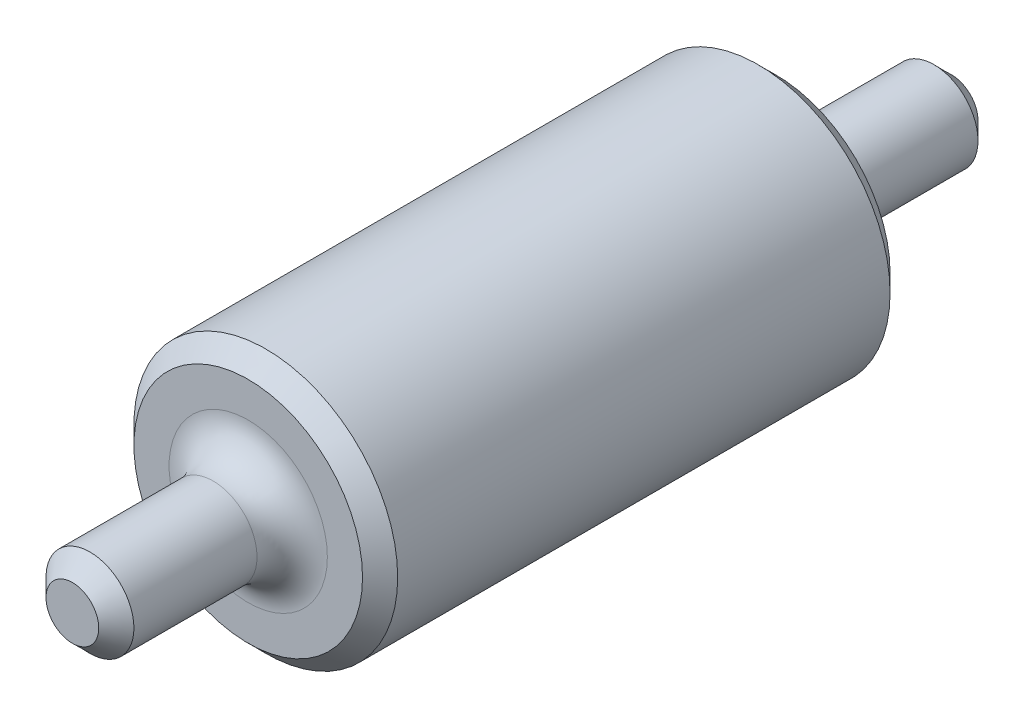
ISO-10303-21;
HEADER;
FILE_DESCRIPTION(('STEP AP214'),'2;1');
FILE_NAME('part.step','',(''),(''),'','','');
FILE_SCHEMA(('AUTOMOTIVE_DESIGN { 1 0 10303 214 1 1 1 1 }'));
ENDSEC;
DATA;
#1=APPLICATION_CONTEXT('core data for automotive mechanical design processes');
#2=APPLICATION_PROTOCOL_DEFINITION('international standard','automotive_design',2000,#1);
#3=PRODUCT_CONTEXT('',#1,'mechanical');
#4=PRODUCT('Part','Part','',(#3));
#5=PRODUCT_RELATED_PRODUCT_CATEGORY('part','',(#4));
#6=PRODUCT_DEFINITION_FORMATION('','',#4);
#7=PRODUCT_DEFINITION_CONTEXT('part definition',#1,'design');
#8=PRODUCT_DEFINITION('design','',#6,#7);
#9=PRODUCT_DEFINITION_SHAPE('','',#8);
#10=(LENGTH_UNIT() NAMED_UNIT(*) SI_UNIT(.MILLI.,.METRE.));
#11=(NAMED_UNIT(*) PLANE_ANGLE_UNIT() SI_UNIT($,.RADIAN.));
#12=(NAMED_UNIT(*) SI_UNIT($,.STERADIAN.) SOLID_ANGLE_UNIT());
#13=UNCERTAINTY_MEASURE_WITH_UNIT(LENGTH_MEASURE(1.E-05),#10,'distance_accuracy_value','');
#14=(GEOMETRIC_REPRESENTATION_CONTEXT(3) GLOBAL_UNCERTAINTY_ASSIGNED_CONTEXT((#13)) GLOBAL_UNIT_ASSIGNED_CONTEXT((#10,
#11,#12)) REPRESENTATION_CONTEXT('',''));
#15=CARTESIAN_POINT('',(0.,0.,0.));
#16=DIRECTION('',(0.,0.,1.));
#17=DIRECTION('',(1.,0.,0.));
#18=AXIS2_PLACEMENT_3D('',#15,#16,#17);
#19=CARTESIAN_POINT('',(0.,0.,15.));
#20=DIRECTION('',(0.,0.,1.));
#21=DIRECTION('',(1.,0.,0.));
#22=AXIS2_PLACEMENT_3D('',#19,#20,#21);
#23=PLANE('',#22);
#24=CARTESIAN_POINT('',(0.,0.,15.));
#25=DIRECTION('',(0.,0.,1.));
#26=DIRECTION('',(1.,0.,0.));
#27=AXIS2_PLACEMENT_3D('',#24,#25,#26);
#28=CIRCLE('',#27,4.5);
#29=CARTESIAN_POINT('',(4.5,0.,15.));
#30=VERTEX_POINT('',#29);
#31=EDGE_CURVE('E10',#30,#30,#28,.F.);
#32=ORIENTED_EDGE('',*,*,#31,.T.);
#33=EDGE_LOOP('',(#32));
#34=FACE_BOUND('',#33,.T.);
#35=CARTESIAN_POINT('',(0.,0.,15.));
#36=DIRECTION('',(0.,0.,1.));
#37=DIRECTION('',(1.,0.,0.));
#38=AXIS2_PLACEMENT_3D('',#35,#36,#37);
#39=CIRCLE('',#38,6.49999999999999);
#40=CARTESIAN_POINT('',(6.49999999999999,0.,15.));
#41=VERTEX_POINT('',#40);
#42=EDGE_CURVE('E63',#41,#41,#39,.T.);
#43=ORIENTED_EDGE('',*,*,#42,.T.);
#44=EDGE_LOOP('',(#43));
#45=FACE_BOUND('',#44,.T.);
#46=ADVANCED_FACE('F31',(#34,#45),#23,.T.);
#47=CARTESIAN_POINT('',(0.,0.,15.));
#48=DIRECTION('',(0.,0.,-1.));
#49=DIRECTION('',(-1.,0.,0.));
#50=AXIS2_PLACEMENT_3D('',#47,#48,#49);
#51=CYLINDRICAL_SURFACE('',#50,7.5);
#52=CARTESIAN_POINT('',(0.,0.,-14.));
#53=DIRECTION('',(0.,0.,1.));
#54=DIRECTION('',(1.,0.,0.));
#55=AXIS2_PLACEMENT_3D('',#52,#53,#54);
#56=CIRCLE('',#55,7.5);
#57=CARTESIAN_POINT('',(7.5,0.,-14.));
#58=VERTEX_POINT('',#57);
#59=EDGE_CURVE('E69',#58,#58,#56,.T.);
#60=ORIENTED_EDGE('',*,*,#59,.T.);
#61=EDGE_LOOP('',(#60));
#62=FACE_BOUND('',#61,.T.);
#63=CARTESIAN_POINT('',(0.,0.,14.));
#64=DIRECTION('',(0.,0.,1.));
#65=DIRECTION('',(1.,0.,0.));
#66=AXIS2_PLACEMENT_3D('',#63,#64,#65);
#67=CIRCLE('',#66,7.5);
#68=CARTESIAN_POINT('',(7.5,0.,14.));
#69=VERTEX_POINT('',#68);
#70=EDGE_CURVE('E72',#69,#69,#67,.F.);
#71=ORIENTED_EDGE('',*,*,#70,.T.);
#72=EDGE_LOOP('',(#71));
#73=FACE_BOUND('',#72,.T.);
#74=ADVANCED_FACE('F76',(#62,#73),#51,.T.);
#75=CARTESIAN_POINT('',(0.,0.,-15.));
#76=DIRECTION('',(0.,0.,1.));
#77=DIRECTION('',(1.,0.,0.));
#78=AXIS2_PLACEMENT_3D('',#75,#76,#77);
#79=PLANE('',#78);
#80=CARTESIAN_POINT('',(0.,0.,-15.));
#81=DIRECTION('',(0.,0.,1.));
#82=DIRECTION('',(1.,0.,0.));
#83=AXIS2_PLACEMENT_3D('',#80,#81,#82);
#84=CIRCLE('',#83,4.5);
#85=CARTESIAN_POINT('',(4.5,0.,-15.));
#86=VERTEX_POINT('',#85);
#87=EDGE_CURVE('E46',#86,#86,#84,.T.);
#88=ORIENTED_EDGE('',*,*,#87,.T.);
#89=EDGE_LOOP('',(#88));
#90=FACE_BOUND('',#89,.T.);
#91=CARTESIAN_POINT('',(0.,0.,-15.));
#92=DIRECTION('',(0.,0.,1.));
#93=DIRECTION('',(1.,0.,0.));
#94=AXIS2_PLACEMENT_3D('',#91,#92,#93);
#95=CIRCLE('',#94,6.49999999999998);
#96=CARTESIAN_POINT('',(6.49999999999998,0.,-15.));
#97=VERTEX_POINT('',#96);
#98=EDGE_CURVE('E66',#97,#97,#95,.F.);
#99=ORIENTED_EDGE('',*,*,#98,.T.);
#100=EDGE_LOOP('',(#99));
#101=FACE_BOUND('',#100,.T.);
#102=ADVANCED_FACE('F91',(#90,#101),#79,.F.);
#103=CARTESIAN_POINT('',(0.,0.,25.));
#104=DIRECTION('',(0.,0.,-1.));
#105=DIRECTION('',(-1.,0.,0.));
#106=AXIS2_PLACEMENT_3D('',#103,#104,#105);
#107=CYLINDRICAL_SURFACE('',#106,2.5);
#108=CARTESIAN_POINT('',(0.,0.,17.));
#109=DIRECTION('',(0.,0.,1.));
#110=DIRECTION('',(1.,0.,0.));
#111=AXIS2_PLACEMENT_3D('',#108,#109,#110);
#112=CIRCLE('',#111,2.5);
#113=CARTESIAN_POINT('',(2.5,0.,17.));
#114=VERTEX_POINT('',#113);
#115=EDGE_CURVE('E38',#114,#114,#112,.T.);
#116=ORIENTED_EDGE('',*,*,#115,.T.);
#117=EDGE_LOOP('',(#116));
#118=FACE_BOUND('',#117,.T.);
#119=CARTESIAN_POINT('',(0.,0.,24.));
#120=DIRECTION('',(0.,0.,1.));
#121=DIRECTION('',(1.,0.,0.));
#122=AXIS2_PLACEMENT_3D('',#119,#120,#121);
#123=CIRCLE('',#122,2.5);
#124=CARTESIAN_POINT('',(2.5,0.,24.));
#125=VERTEX_POINT('',#124);
#126=EDGE_CURVE('E51',#125,#125,#123,.F.);
#127=ORIENTED_EDGE('',*,*,#126,.T.);
#128=EDGE_LOOP('',(#127));
#129=FACE_BOUND('',#128,.T.);
#130=ADVANCED_FACE('F96',(#118,#129),#107,.T.);
#131=CARTESIAN_POINT('',(0.,0.,25.));
#132=DIRECTION('',(0.,0.,1.));
#133=DIRECTION('',(1.,0.,0.));
#134=AXIS2_PLACEMENT_3D('',#131,#132,#133);
#135=PLANE('',#134);
#136=CARTESIAN_POINT('',(0.,0.,25.));
#137=DIRECTION('',(0.,0.,1.));
#138=DIRECTION('',(1.,0.,0.));
#139=AXIS2_PLACEMENT_3D('',#136,#137,#138);
#140=CIRCLE('',#139,1.5);
#141=CARTESIAN_POINT('',(1.5,0.,25.));
#142=VERTEX_POINT('',#141);
#143=EDGE_CURVE('E54',#142,#142,#140,.T.);
#144=ORIENTED_EDGE('',*,*,#143,.T.);
#145=EDGE_LOOP('',(#144));
#146=FACE_BOUND('',#145,.T.);
#147=ADVANCED_FACE('F129',(#146),#135,.T.);
#148=CARTESIAN_POINT('',(0.,0.,-25.));
#149=DIRECTION('',(0.,0.,1.));
#150=DIRECTION('',(1.,0.,0.));
#151=AXIS2_PLACEMENT_3D('',#148,#149,#150);
#152=CYLINDRICAL_SURFACE('',#151,2.5);
#153=CARTESIAN_POINT('',(0.,0.,-17.));
#154=DIRECTION('',(0.,0.,1.));
#155=DIRECTION('',(1.,0.,0.));
#156=AXIS2_PLACEMENT_3D('',#153,#154,#155);
#157=CIRCLE('',#156,2.5);
#158=CARTESIAN_POINT('',(2.5,0.,-17.));
#159=VERTEX_POINT('',#158);
#160=EDGE_CURVE('E42',#159,#159,#157,.F.);
#161=ORIENTED_EDGE('',*,*,#160,.T.);
#162=EDGE_LOOP('',(#161));
#163=FACE_BOUND('',#162,.T.);
#164=CARTESIAN_POINT('',(0.,0.,-24.));
#165=DIRECTION('',(0.,0.,-1.));
#166=DIRECTION('',(-1.,0.,0.));
#167=AXIS2_PLACEMENT_3D('',#164,#165,#166);
#168=CIRCLE('',#167,2.5);
#169=CARTESIAN_POINT('',(-2.5,0.,-24.));
#170=VERTEX_POINT('',#169);
#171=EDGE_CURVE('E60',#170,#170,#168,.F.);
#172=ORIENTED_EDGE('',*,*,#171,.T.);
#173=EDGE_LOOP('',(#172));
#174=FACE_BOUND('',#173,.T.);
#175=ADVANCED_FACE('F126',(#163,#174),#152,.T.);
#176=CARTESIAN_POINT('',(0.,0.,-25.));
#177=DIRECTION('',(0.,0.,-1.));
#178=DIRECTION('',(1.,0.,0.));
#179=AXIS2_PLACEMENT_3D('',#176,#177,#178);
#180=PLANE('',#179);
#181=CARTESIAN_POINT('',(0.,0.,-25.));
#182=DIRECTION('',(0.,0.,-1.));
#183=DIRECTION('',(-1.,0.,0.));
#184=AXIS2_PLACEMENT_3D('',#181,#182,#183);
#185=CIRCLE('',#184,1.49999999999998);
#186=CARTESIAN_POINT('',(-1.49999999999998,0.,-25.));
#187=VERTEX_POINT('',#186);
#188=EDGE_CURVE('E57',#187,#187,#185,.T.);
#189=ORIENTED_EDGE('',*,*,#188,.T.);
#190=EDGE_LOOP('',(#189));
#191=FACE_BOUND('',#190,.T.);
#192=ADVANCED_FACE('F102',(#191),#180,.T.);
#193=CARTESIAN_POINT('',(0.,0.,-14.));
#194=DIRECTION('',(0.,0.,1.));
#195=DIRECTION('',(1.,0.,0.));
#196=AXIS2_PLACEMENT_3D('',#193,#194,#195);
#197=CONICAL_SURFACE('',#196,7.5,0.785398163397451);
#198=ORIENTED_EDGE('',*,*,#98,.F.);
#199=EDGE_LOOP('',(#198));
#200=FACE_BOUND('',#199,.T.);
#201=ORIENTED_EDGE('',*,*,#59,.F.);
#202=EDGE_LOOP('',(#201));
#203=FACE_BOUND('',#202,.T.);
#204=ADVANCED_FACE('F82',(#200,#203),#197,.T.);
#205=CARTESIAN_POINT('',(0.,0.,15.));
#206=DIRECTION('',(0.,0.,-1.));
#207=DIRECTION('',(-1.,0.,0.));
#208=AXIS2_PLACEMENT_3D('',#205,#206,#207);
#209=CONICAL_SURFACE('',#208,6.49999999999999,0.785398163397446);
#210=ORIENTED_EDGE('',*,*,#70,.F.);
#211=EDGE_LOOP('',(#210));
#212=FACE_BOUND('',#211,.T.);
#213=ORIENTED_EDGE('',*,*,#42,.F.);
#214=EDGE_LOOP('',(#213));
#215=FACE_BOUND('',#214,.T.);
#216=ADVANCED_FACE('F78',(#212,#215),#209,.T.);
#217=CARTESIAN_POINT('',(0.,0.,-24.));
#218=DIRECTION('',(0.,0.,1.));
#219=DIRECTION('',(1.,0.,0.));
#220=AXIS2_PLACEMENT_3D('',#217,#218,#219);
#221=CONICAL_SURFACE('',#220,2.5,0.785398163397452);
#222=ORIENTED_EDGE('',*,*,#188,.F.);
#223=EDGE_LOOP('',(#222));
#224=FACE_BOUND('',#223,.T.);
#225=ORIENTED_EDGE('',*,*,#171,.F.);
#226=EDGE_LOOP('',(#225));
#227=FACE_BOUND('',#226,.T.);
#228=ADVANCED_FACE('F81',(#224,#227),#221,.T.);
#229=CARTESIAN_POINT('',(0.,0.,25.));
#230=DIRECTION('',(0.,0.,-1.));
#231=DIRECTION('',(-1.,0.,0.));
#232=AXIS2_PLACEMENT_3D('',#229,#230,#231);
#233=CONICAL_SURFACE('',#232,1.5,0.785398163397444);
#234=ORIENTED_EDGE('',*,*,#126,.F.);
#235=EDGE_LOOP('',(#234));
#236=FACE_BOUND('',#235,.T.);
#237=ORIENTED_EDGE('',*,*,#143,.F.);
#238=EDGE_LOOP('',(#237));
#239=FACE_BOUND('',#238,.T.);
#240=ADVANCED_FACE('F107',(#236,#239),#233,.T.);
#241=CARTESIAN_POINT('',(0.,0.,-17.));
#242=DIRECTION('',(0.,0.,1.));
#243=DIRECTION('',(1.,0.,0.));
#244=AXIS2_PLACEMENT_3D('',#241,#242,#243);
#245=TOROIDAL_SURFACE('',#244,4.5,2.);
#246=ORIENTED_EDGE('',*,*,#160,.F.);
#247=EDGE_LOOP('',(#246));
#248=FACE_BOUND('',#247,.T.);
#249=ORIENTED_EDGE('',*,*,#87,.F.);
#250=EDGE_LOOP('',(#249));
#251=FACE_BOUND('',#250,.T.);
#252=ADVANCED_FACE('F110',(#248,#251),#245,.F.);
#253=CARTESIAN_POINT('',(0.,0.,17.));
#254=DIRECTION('',(0.,0.,1.));
#255=DIRECTION('',(1.,0.,0.));
#256=AXIS2_PLACEMENT_3D('',#253,#254,#255);
#257=TOROIDAL_SURFACE('',#256,4.5,2.);
#258=ORIENTED_EDGE('',*,*,#31,.F.);
#259=EDGE_LOOP('',(#258));
#260=FACE_BOUND('',#259,.T.);
#261=ORIENTED_EDGE('',*,*,#115,.F.);
#262=EDGE_LOOP('',(#261));
#263=FACE_BOUND('',#262,.T.);
#264=ADVANCED_FACE('F33',(#260,#263),#257,.F.);
#265=CLOSED_SHELL('',(#46,#74,#102,#130,#147,#175,#192,#204,#216,#228,#240,#252,#264));
#266=MANIFOLD_SOLID_BREP('B2',#265);
#267=ADVANCED_BREP_SHAPE_REPRESENTATION('',(#18,#266),#14);
#268=SHAPE_DEFINITION_REPRESENTATION(#9,#267);
ENDSEC;
END-ISO-10303-21;
